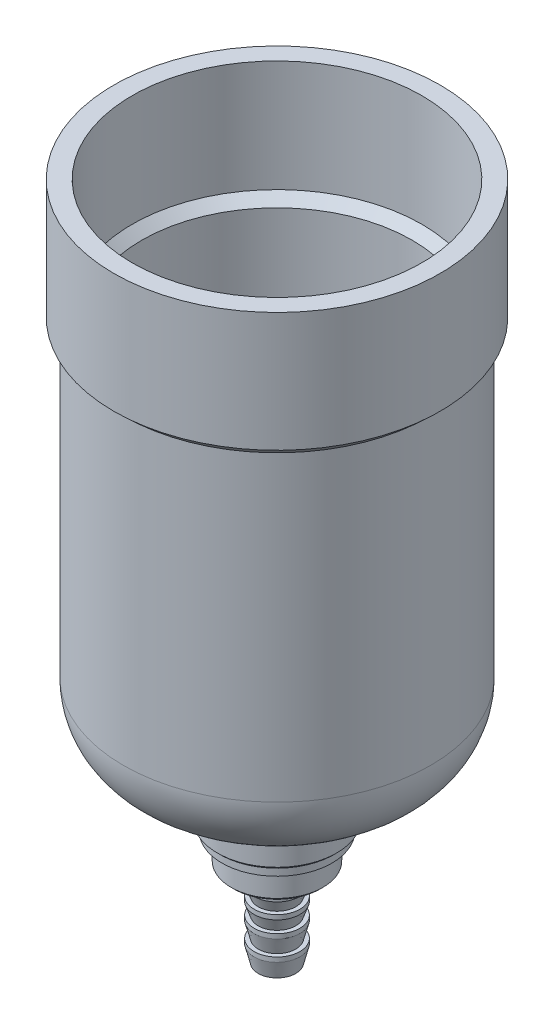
ISO-10303-21;
HEADER;
FILE_DESCRIPTION(('STEP AP214'),'2;1');
FILE_NAME('part.step','',(''),(''),'','','');
FILE_SCHEMA(('AUTOMOTIVE_DESIGN { 1 0 10303 214 1 1 1 1 }'));
ENDSEC;
DATA;
#1=APPLICATION_CONTEXT('core data for automotive mechanical design processes');
#2=APPLICATION_PROTOCOL_DEFINITION('international standard','automotive_design',2000,#1);
#3=PRODUCT_CONTEXT('',#1,'mechanical');
#4=PRODUCT('Part','Part','',(#3));
#5=PRODUCT_RELATED_PRODUCT_CATEGORY('part','',(#4));
#6=PRODUCT_DEFINITION_FORMATION('','',#4);
#7=PRODUCT_DEFINITION_CONTEXT('part definition',#1,'design');
#8=PRODUCT_DEFINITION('design','',#6,#7);
#9=PRODUCT_DEFINITION_SHAPE('','',#8);
#10=(LENGTH_UNIT() NAMED_UNIT(*) SI_UNIT(.MILLI.,.METRE.));
#11=(NAMED_UNIT(*) PLANE_ANGLE_UNIT() SI_UNIT($,.RADIAN.));
#12=(NAMED_UNIT(*) SI_UNIT($,.STERADIAN.) SOLID_ANGLE_UNIT());
#13=UNCERTAINTY_MEASURE_WITH_UNIT(LENGTH_MEASURE(1.E-05),#10,'distance_accuracy_value','');
#14=(GEOMETRIC_REPRESENTATION_CONTEXT(3) GLOBAL_UNCERTAINTY_ASSIGNED_CONTEXT((#13)) GLOBAL_UNIT_ASSIGNED_CONTEXT((#10,
#11,#12)) REPRESENTATION_CONTEXT('',''));
#15=CARTESIAN_POINT('',(0.,0.,0.));
#16=DIRECTION('',(0.,0.,1.));
#17=DIRECTION('',(1.,0.,0.));
#18=AXIS2_PLACEMENT_3D('',#15,#16,#17);
#19=CARTESIAN_POINT('',(0.,0.,0.));
#20=DIRECTION('',(0.,-1.,0.));
#21=DIRECTION('',(0.,0.,-1.));
#22=AXIS2_PLACEMENT_3D('',#19,#20,#21);
#23=CYLINDRICAL_SURFACE('',#22,17.8);
#24=CARTESIAN_POINT('',(0.,-13.0208591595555,0.));
#25=DIRECTION('',(0.,-1.,0.));
#26=DIRECTION('',(0.,0.,-1.));
#27=AXIS2_PLACEMENT_3D('',#24,#25,#26);
#28=CIRCLE('',#27,17.8);
#29=CARTESIAN_POINT('',(0.,-13.0208591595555,-17.8));
#30=VERTEX_POINT('',#29);
#31=EDGE_CURVE('E10',#30,#30,#28,.T.);
#32=ORIENTED_EDGE('',*,*,#31,.F.);
#33=EDGE_LOOP('',(#32));
#34=FACE_BOUND('',#33,.T.);
#35=CARTESIAN_POINT('',(0.,0.,0.));
#36=DIRECTION('',(0.,-1.,0.));
#37=DIRECTION('',(0.,0.,-1.));
#38=AXIS2_PLACEMENT_3D('',#35,#36,#37);
#39=CIRCLE('',#38,17.8);
#40=CARTESIAN_POINT('',(0.,0.,-17.8));
#41=VERTEX_POINT('',#40);
#42=EDGE_CURVE('E142',#41,#41,#39,.T.);
#43=ORIENTED_EDGE('',*,*,#42,.T.);
#44=EDGE_LOOP('',(#43));
#45=FACE_BOUND('',#44,.T.);
#46=ADVANCED_FACE('F33',(#34,#45),#23,.T.);
#47=CARTESIAN_POINT('',(0.,-13.0208591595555,0.));
#48=DIRECTION('',(0.,1.,0.));
#49=DIRECTION('',(0.,0.,1.));
#50=AXIS2_PLACEMENT_3D('',#47,#48,#49);
#51=CONICAL_SURFACE('',#50,17.8,0.820304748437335);
#52=CARTESIAN_POINT('',(0.,-14.,0.));
#53=DIRECTION('',(0.,-1.,0.));
#54=DIRECTION('',(0.,0.,-1.));
#55=AXIS2_PLACEMENT_3D('',#52,#53,#54);
#56=CIRCLE('',#55,16.75);
#57=CARTESIAN_POINT('',(0.,-14.,-16.75));
#58=VERTEX_POINT('',#57);
#59=EDGE_CURVE('E39',#58,#58,#56,.T.);
#60=ORIENTED_EDGE('',*,*,#59,.F.);
#61=EDGE_LOOP('',(#60));
#62=FACE_BOUND('',#61,.T.);
#63=ORIENTED_EDGE('',*,*,#31,.T.);
#64=EDGE_LOOP('',(#63));
#65=FACE_BOUND('',#64,.T.);
#66=ADVANCED_FACE('F341',(#62,#65),#51,.T.);
#67=CARTESIAN_POINT('',(0.,0.,0.));
#68=DIRECTION('',(0.,-1.,0.));
#69=DIRECTION('',(0.,0.,-1.));
#70=AXIS2_PLACEMENT_3D('',#67,#68,#69);
#71=CYLINDRICAL_SURFACE('',#70,16.75);
#72=CARTESIAN_POINT('',(0.,-47.,0.));
#73=DIRECTION('',(0.,-1.,0.));
#74=DIRECTION('',(0.,0.,-1.));
#75=AXIS2_PLACEMENT_3D('',#72,#73,#74);
#76=CIRCLE('',#75,16.75);
#77=CARTESIAN_POINT('',(0.,-47.,-16.75));
#78=VERTEX_POINT('',#77);
#79=EDGE_CURVE('E43',#78,#78,#76,.T.);
#80=ORIENTED_EDGE('',*,*,#79,.F.);
#81=EDGE_LOOP('',(#80));
#82=FACE_BOUND('',#81,.T.);
#83=ORIENTED_EDGE('',*,*,#59,.T.);
#84=EDGE_LOOP('',(#83));
#85=FACE_BOUND('',#84,.T.);
#86=ADVANCED_FACE('F336',(#82,#85),#71,.T.);
#87=CARTESIAN_POINT('',(0.,-47.,0.));
#88=DIRECTION('',(0.,-1.,0.));
#89=DIRECTION('',(0.,0.,-1.));
#90=AXIS2_PLACEMENT_3D('',#87,#88,#89);
#91=TOROIDAL_SURFACE('',#90,8.75,8.);
#92=CARTESIAN_POINT('',(0.,-55.,0.));
#93=DIRECTION('',(0.,-1.,0.));
#94=DIRECTION('',(0.,0.,-1.));
#95=AXIS2_PLACEMENT_3D('',#92,#93,#94);
#96=CIRCLE('',#95,8.75);
#97=CARTESIAN_POINT('',(0.,-55.,-8.75));
#98=VERTEX_POINT('',#97);
#99=EDGE_CURVE('E47',#98,#98,#96,.T.);
#100=ORIENTED_EDGE('',*,*,#99,.F.);
#101=EDGE_LOOP('',(#100));
#102=FACE_BOUND('',#101,.T.);
#103=ORIENTED_EDGE('',*,*,#79,.T.);
#104=EDGE_LOOP('',(#103));
#105=FACE_BOUND('',#104,.T.);
#106=ADVANCED_FACE('F330',(#102,#105),#91,.T.);
#107=CARTESIAN_POINT('',(-8.75,-55.,0.));
#108=DIRECTION('',(0.,1.,0.));
#109=DIRECTION('',(0.,0.,1.));
#110=AXIS2_PLACEMENT_3D('',#107,#108,#109);
#111=PLANE('',#110);
#112=CARTESIAN_POINT('',(0.,-55.,0.));
#113=DIRECTION('',(0.,-1.,0.));
#114=DIRECTION('',(0.,0.,-1.));
#115=AXIS2_PLACEMENT_3D('',#112,#113,#114);
#116=CIRCLE('',#115,7.5);
#117=CARTESIAN_POINT('',(0.,-55.,-7.5));
#118=VERTEX_POINT('',#117);
#119=EDGE_CURVE('E52',#118,#118,#116,.T.);
#120=ORIENTED_EDGE('',*,*,#119,.F.);
#121=EDGE_LOOP('',(#120));
#122=FACE_BOUND('',#121,.T.);
#123=ORIENTED_EDGE('',*,*,#99,.T.);
#124=EDGE_LOOP('',(#123));
#125=FACE_BOUND('',#124,.T.);
#126=ADVANCED_FACE('F324',(#122,#125),#111,.F.);
#127=CARTESIAN_POINT('',(0.,-56.,0.));
#128=DIRECTION('',(0.,-1.,0.));
#129=DIRECTION('',(0.,0.,-1.));
#130=AXIS2_PLACEMENT_3D('',#127,#128,#129);
#131=TOROIDAL_SURFACE('',#130,7.5,1.);
#132=CARTESIAN_POINT('',(0.,-56.,0.));
#133=DIRECTION('',(0.,-1.,0.));
#134=DIRECTION('',(0.,0.,-1.));
#135=AXIS2_PLACEMENT_3D('',#132,#133,#134);
#136=CIRCLE('',#135,6.5);
#137=CARTESIAN_POINT('',(0.,-56.,-6.5));
#138=VERTEX_POINT('',#137);
#139=EDGE_CURVE('E55',#138,#138,#136,.T.);
#140=ORIENTED_EDGE('',*,*,#139,.F.);
#141=EDGE_LOOP('',(#140));
#142=FACE_BOUND('',#141,.T.);
#143=ORIENTED_EDGE('',*,*,#119,.T.);
#144=EDGE_LOOP('',(#143));
#145=FACE_BOUND('',#144,.T.);
#146=ADVANCED_FACE('F318',(#142,#145),#131,.F.);
#147=CARTESIAN_POINT('',(0.,0.,0.));
#148=DIRECTION('',(0.,-1.,0.));
#149=DIRECTION('',(0.,0.,-1.));
#150=AXIS2_PLACEMENT_3D('',#147,#148,#149);
#151=CYLINDRICAL_SURFACE('',#150,6.5);
#152=CARTESIAN_POINT('',(0.,-60.4,0.));
#153=DIRECTION('',(0.,-1.,0.));
#154=DIRECTION('',(0.,0.,-1.));
#155=AXIS2_PLACEMENT_3D('',#152,#153,#154);
#156=CIRCLE('',#155,6.5);
#157=CARTESIAN_POINT('',(0.,-60.4,-6.5));
#158=VERTEX_POINT('',#157);
#159=EDGE_CURVE('E58',#158,#158,#156,.T.);
#160=ORIENTED_EDGE('',*,*,#159,.F.);
#161=EDGE_LOOP('',(#160));
#162=FACE_BOUND('',#161,.T.);
#163=ORIENTED_EDGE('',*,*,#139,.T.);
#164=EDGE_LOOP('',(#163));
#165=FACE_BOUND('',#164,.T.);
#166=ADVANCED_FACE('F312',(#162,#165),#151,.T.);
#167=CARTESIAN_POINT('',(0.,-60.4,0.));
#168=DIRECTION('',(0.,1.,0.));
#169=DIRECTION('',(0.,0.,1.));
#170=AXIS2_PLACEMENT_3D('',#167,#168,#169);
#171=CONICAL_SURFACE('',#170,6.5,0.785398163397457);
#172=CARTESIAN_POINT('',(0.,-60.7,0.));
#173=DIRECTION('',(0.,-1.,0.));
#174=DIRECTION('',(0.,0.,-1.));
#175=AXIS2_PLACEMENT_3D('',#172,#173,#174);
#176=CIRCLE('',#175,6.2);
#177=CARTESIAN_POINT('',(0.,-60.7,-6.2));
#178=VERTEX_POINT('',#177);
#179=EDGE_CURVE('E61',#178,#178,#176,.T.);
#180=ORIENTED_EDGE('',*,*,#179,.F.);
#181=EDGE_LOOP('',(#180));
#182=FACE_BOUND('',#181,.T.);
#183=ORIENTED_EDGE('',*,*,#159,.T.);
#184=EDGE_LOOP('',(#183));
#185=FACE_BOUND('',#184,.T.);
#186=ADVANCED_FACE('F306',(#182,#185),#171,.T.);
#187=CARTESIAN_POINT('',(-6.2,-60.7,0.));
#188=DIRECTION('',(0.,1.,0.));
#189=DIRECTION('',(0.,0.,1.));
#190=AXIS2_PLACEMENT_3D('',#187,#188,#189);
#191=PLANE('',#190);
#192=CARTESIAN_POINT('',(0.,-60.7,0.));
#193=DIRECTION('',(0.,-1.,0.));
#194=DIRECTION('',(0.,0.,-1.));
#195=AXIS2_PLACEMENT_3D('',#192,#193,#194);
#196=CIRCLE('',#195,6.);
#197=CARTESIAN_POINT('',(0.,-60.7,-6.));
#198=VERTEX_POINT('',#197);
#199=EDGE_CURVE('E64',#198,#198,#196,.T.);
#200=ORIENTED_EDGE('',*,*,#199,.F.);
#201=EDGE_LOOP('',(#200));
#202=FACE_BOUND('',#201,.T.);
#203=ORIENTED_EDGE('',*,*,#179,.T.);
#204=EDGE_LOOP('',(#203));
#205=FACE_BOUND('',#204,.T.);
#206=ADVANCED_FACE('F300',(#202,#205),#191,.F.);
#207=CARTESIAN_POINT('',(0.,0.,0.));
#208=DIRECTION('',(0.,-1.,0.));
#209=DIRECTION('',(0.,0.,-1.));
#210=AXIS2_PLACEMENT_3D('',#207,#208,#209);
#211=CYLINDRICAL_SURFACE('',#210,6.);
#212=CARTESIAN_POINT('',(0.,-61.6,0.));
#213=DIRECTION('',(0.,-1.,0.));
#214=DIRECTION('',(0.,0.,-1.));
#215=AXIS2_PLACEMENT_3D('',#212,#213,#214);
#216=CIRCLE('',#215,6.);
#217=CARTESIAN_POINT('',(0.,-61.6,-6.));
#218=VERTEX_POINT('',#217);
#219=EDGE_CURVE('E67',#218,#218,#216,.T.);
#220=ORIENTED_EDGE('',*,*,#219,.F.);
#221=EDGE_LOOP('',(#220));
#222=FACE_BOUND('',#221,.T.);
#223=ORIENTED_EDGE('',*,*,#199,.T.);
#224=EDGE_LOOP('',(#223));
#225=FACE_BOUND('',#224,.T.);
#226=ADVANCED_FACE('F294',(#222,#225),#211,.T.);
#227=CARTESIAN_POINT('',(-6.,-61.6,0.));
#228=DIRECTION('',(0.,1.,0.));
#229=DIRECTION('',(0.,0.,1.));
#230=AXIS2_PLACEMENT_3D('',#227,#228,#229);
#231=PLANE('',#230);
#232=CARTESIAN_POINT('',(0.,-61.6,0.));
#233=DIRECTION('',(0.,-1.,0.));
#234=DIRECTION('',(0.,0.,-1.));
#235=AXIS2_PLACEMENT_3D('',#232,#233,#234);
#236=CIRCLE('',#235,5.);
#237=CARTESIAN_POINT('',(0.,-61.6,-5.));
#238=VERTEX_POINT('',#237);
#239=EDGE_CURVE('E70',#238,#238,#236,.T.);
#240=ORIENTED_EDGE('',*,*,#239,.F.);
#241=EDGE_LOOP('',(#240));
#242=FACE_BOUND('',#241,.T.);
#243=ORIENTED_EDGE('',*,*,#219,.T.);
#244=EDGE_LOOP('',(#243));
#245=FACE_BOUND('',#244,.T.);
#246=ADVANCED_FACE('F288',(#242,#245),#231,.F.);
#247=CARTESIAN_POINT('',(0.,0.,0.));
#248=DIRECTION('',(0.,-1.,0.));
#249=DIRECTION('',(0.,0.,-1.));
#250=AXIS2_PLACEMENT_3D('',#247,#248,#249);
#251=CYLINDRICAL_SURFACE('',#250,5.);
#252=CARTESIAN_POINT('',(0.,-64.4,0.));
#253=DIRECTION('',(0.,-1.,0.));
#254=DIRECTION('',(0.,0.,-1.));
#255=AXIS2_PLACEMENT_3D('',#252,#253,#254);
#256=CIRCLE('',#255,5.);
#257=CARTESIAN_POINT('',(0.,-64.4,-5.));
#258=VERTEX_POINT('',#257);
#259=EDGE_CURVE('E73',#258,#258,#256,.T.);
#260=ORIENTED_EDGE('',*,*,#259,.F.);
#261=EDGE_LOOP('',(#260));
#262=FACE_BOUND('',#261,.T.);
#263=ORIENTED_EDGE('',*,*,#239,.T.);
#264=EDGE_LOOP('',(#263));
#265=FACE_BOUND('',#264,.T.);
#266=ADVANCED_FACE('F282',(#262,#265),#251,.T.);
#267=CARTESIAN_POINT('',(0.,-64.4,0.));
#268=DIRECTION('',(0.,1.,0.));
#269=DIRECTION('',(0.,0.,1.));
#270=AXIS2_PLACEMENT_3D('',#267,#268,#269);
#271=CONICAL_SURFACE('',#270,5.,0.785398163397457);
#272=CARTESIAN_POINT('',(0.,-64.7,0.));
#273=DIRECTION('',(0.,-1.,0.));
#274=DIRECTION('',(0.,0.,-1.));
#275=AXIS2_PLACEMENT_3D('',#272,#273,#274);
#276=CIRCLE('',#275,4.7);
#277=CARTESIAN_POINT('',(0.,-64.7,-4.7));
#278=VERTEX_POINT('',#277);
#279=EDGE_CURVE('E76',#278,#278,#276,.T.);
#280=ORIENTED_EDGE('',*,*,#279,.F.);
#281=EDGE_LOOP('',(#280));
#282=FACE_BOUND('',#281,.T.);
#283=ORIENTED_EDGE('',*,*,#259,.T.);
#284=EDGE_LOOP('',(#283));
#285=FACE_BOUND('',#284,.T.);
#286=ADVANCED_FACE('F276',(#282,#285),#271,.T.);
#287=CARTESIAN_POINT('',(-4.7,-64.7,0.));
#288=DIRECTION('',(0.,1.,0.));
#289=DIRECTION('',(0.,0.,1.));
#290=AXIS2_PLACEMENT_3D('',#287,#288,#289);
#291=PLANE('',#290);
#292=CARTESIAN_POINT('',(0.,-64.7,0.));
#293=DIRECTION('',(0.,-1.,0.));
#294=DIRECTION('',(0.,0.,-1.));
#295=AXIS2_PLACEMENT_3D('',#292,#293,#294);
#296=CIRCLE('',#295,3.5);
#297=CARTESIAN_POINT('',(0.,-64.7,-3.5));
#298=VERTEX_POINT('',#297);
#299=EDGE_CURVE('E79',#298,#298,#296,.T.);
#300=ORIENTED_EDGE('',*,*,#299,.F.);
#301=EDGE_LOOP('',(#300));
#302=FACE_BOUND('',#301,.T.);
#303=ORIENTED_EDGE('',*,*,#279,.T.);
#304=EDGE_LOOP('',(#303));
#305=FACE_BOUND('',#304,.T.);
#306=ADVANCED_FACE('F270',(#302,#305),#291,.F.);
#307=CARTESIAN_POINT('',(0.,0.,0.));
#308=DIRECTION('',(0.,-1.,0.));
#309=DIRECTION('',(0.,0.,-1.));
#310=AXIS2_PLACEMENT_3D('',#307,#308,#309);
#311=CYLINDRICAL_SURFACE('',#310,3.5);
#312=CARTESIAN_POINT('',(0.,-65.5,0.));
#313=DIRECTION('',(0.,-1.,0.));
#314=DIRECTION('',(0.,0.,-1.));
#315=AXIS2_PLACEMENT_3D('',#312,#313,#314);
#316=CIRCLE('',#315,3.5);
#317=CARTESIAN_POINT('',(0.,-65.5,-3.5));
#318=VERTEX_POINT('',#317);
#319=EDGE_CURVE('E82',#318,#318,#316,.T.);
#320=ORIENTED_EDGE('',*,*,#319,.F.);
#321=EDGE_LOOP('',(#320));
#322=FACE_BOUND('',#321,.T.);
#323=ORIENTED_EDGE('',*,*,#299,.T.);
#324=EDGE_LOOP('',(#323));
#325=FACE_BOUND('',#324,.T.);
#326=ADVANCED_FACE('F264',(#322,#325),#311,.T.);
#327=CARTESIAN_POINT('',(-3.5,-65.5,0.));
#328=DIRECTION('',(0.,1.,0.));
#329=DIRECTION('',(0.,0.,1.));
#330=AXIS2_PLACEMENT_3D('',#327,#328,#329);
#331=PLANE('',#330);
#332=CARTESIAN_POINT('',(0.,-65.5,0.));
#333=DIRECTION('',(0.,-1.,0.));
#334=DIRECTION('',(0.,0.,-1.));
#335=AXIS2_PLACEMENT_3D('',#332,#333,#334);
#336=CIRCLE('',#335,2.5);
#337=CARTESIAN_POINT('',(0.,-65.5,-2.5));
#338=VERTEX_POINT('',#337);
#339=EDGE_CURVE('E85',#338,#338,#336,.T.);
#340=ORIENTED_EDGE('',*,*,#339,.F.);
#341=EDGE_LOOP('',(#340));
#342=FACE_BOUND('',#341,.T.);
#343=ORIENTED_EDGE('',*,*,#319,.T.);
#344=EDGE_LOOP('',(#343));
#345=FACE_BOUND('',#344,.T.);
#346=ADVANCED_FACE('F258',(#342,#345),#331,.F.);
#347=CARTESIAN_POINT('',(0.,0.,0.));
#348=DIRECTION('',(0.,-1.,0.));
#349=DIRECTION('',(0.,0.,-1.));
#350=AXIS2_PLACEMENT_3D('',#347,#348,#349);
#351=CYLINDRICAL_SURFACE('',#350,2.5);
#352=CARTESIAN_POINT('',(0.,-66.5,0.));
#353=DIRECTION('',(0.,-1.,0.));
#354=DIRECTION('',(0.,0.,-1.));
#355=AXIS2_PLACEMENT_3D('',#352,#353,#354);
#356=CIRCLE('',#355,2.5);
#357=CARTESIAN_POINT('',(0.,-66.5,-2.5));
#358=VERTEX_POINT('',#357);
#359=EDGE_CURVE('E88',#358,#358,#356,.T.);
#360=ORIENTED_EDGE('',*,*,#359,.F.);
#361=EDGE_LOOP('',(#360));
#362=FACE_BOUND('',#361,.T.);
#363=ORIENTED_EDGE('',*,*,#339,.T.);
#364=EDGE_LOOP('',(#363));
#365=FACE_BOUND('',#364,.T.);
#366=ADVANCED_FACE('F252',(#362,#365),#351,.T.);
#367=CARTESIAN_POINT('',(0.,-66.5,0.));
#368=DIRECTION('',(0.,1.,0.));
#369=DIRECTION('',(0.,0.,1.));
#370=AXIS2_PLACEMENT_3D('',#367,#368,#369);
#371=CONICAL_SURFACE('',#370,2.5,0.358770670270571);
#372=CARTESIAN_POINT('',(0.,-67.7,0.));
#373=DIRECTION('',(0.,-1.,0.));
#374=DIRECTION('',(0.,0.,-1.));
#375=AXIS2_PLACEMENT_3D('',#372,#373,#374);
#376=CIRCLE('',#375,2.05);
#377=CARTESIAN_POINT('',(0.,-67.7,-2.05));
#378=VERTEX_POINT('',#377);
#379=EDGE_CURVE('E91',#378,#378,#376,.T.);
#380=ORIENTED_EDGE('',*,*,#379,.F.);
#381=EDGE_LOOP('',(#380));
#382=FACE_BOUND('',#381,.T.);
#383=ORIENTED_EDGE('',*,*,#359,.T.);
#384=EDGE_LOOP('',(#383));
#385=FACE_BOUND('',#384,.T.);
#386=ADVANCED_FACE('F246',(#382,#385),#371,.T.);
#387=CARTESIAN_POINT('',(-2.05,-67.7,0.));
#388=DIRECTION('',(0.,-1.,0.));
#389=DIRECTION('',(0.,0.,-1.));
#390=AXIS2_PLACEMENT_3D('',#387,#388,#389);
#391=PLANE('',#390);
#392=CARTESIAN_POINT('',(0.,-67.7,0.));
#393=DIRECTION('',(0.,-1.,0.));
#394=DIRECTION('',(0.,0.,-1.));
#395=AXIS2_PLACEMENT_3D('',#392,#393,#394);
#396=CIRCLE('',#395,2.5);
#397=CARTESIAN_POINT('',(0.,-67.7,-2.5));
#398=VERTEX_POINT('',#397);
#399=EDGE_CURVE('E94',#398,#398,#396,.T.);
#400=ORIENTED_EDGE('',*,*,#399,.F.);
#401=EDGE_LOOP('',(#400));
#402=FACE_BOUND('',#401,.T.);
#403=ORIENTED_EDGE('',*,*,#379,.T.);
#404=EDGE_LOOP('',(#403));
#405=FACE_BOUND('',#404,.T.);
#406=ADVANCED_FACE('F240',(#402,#405),#391,.F.);
#407=CARTESIAN_POINT('',(0.,0.,0.));
#408=DIRECTION('',(0.,-1.,0.));
#409=DIRECTION('',(0.,0.,-1.));
#410=AXIS2_PLACEMENT_3D('',#407,#408,#409);
#411=CYLINDRICAL_SURFACE('',#410,2.5);
#412=CARTESIAN_POINT('',(0.,-68.2,0.));
#413=DIRECTION('',(0.,-1.,0.));
#414=DIRECTION('',(0.,0.,-1.));
#415=AXIS2_PLACEMENT_3D('',#412,#413,#414);
#416=CIRCLE('',#415,2.5);
#417=CARTESIAN_POINT('',(0.,-68.2,-2.5));
#418=VERTEX_POINT('',#417);
#419=EDGE_CURVE('E97',#418,#418,#416,.T.);
#420=ORIENTED_EDGE('',*,*,#419,.F.);
#421=EDGE_LOOP('',(#420));
#422=FACE_BOUND('',#421,.T.);
#423=ORIENTED_EDGE('',*,*,#399,.T.);
#424=EDGE_LOOP('',(#423));
#425=FACE_BOUND('',#424,.T.);
#426=ADVANCED_FACE('F234',(#422,#425),#411,.T.);
#427=CARTESIAN_POINT('',(0.,-68.2,0.));
#428=DIRECTION('',(0.,1.,0.));
#429=DIRECTION('',(0.,0.,1.));
#430=AXIS2_PLACEMENT_3D('',#427,#428,#429);
#431=CONICAL_SURFACE('',#430,2.5,0.333244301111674);
#432=CARTESIAN_POINT('',(0.,-69.5,0.));
#433=DIRECTION('',(0.,-1.,0.));
#434=DIRECTION('',(0.,0.,-1.));
#435=AXIS2_PLACEMENT_3D('',#432,#433,#434);
#436=CIRCLE('',#435,2.05);
#437=CARTESIAN_POINT('',(0.,-69.5,-2.05));
#438=VERTEX_POINT('',#437);
#439=EDGE_CURVE('E100',#438,#438,#436,.T.);
#440=ORIENTED_EDGE('',*,*,#439,.F.);
#441=EDGE_LOOP('',(#440));
#442=FACE_BOUND('',#441,.T.);
#443=ORIENTED_EDGE('',*,*,#419,.T.);
#444=EDGE_LOOP('',(#443));
#445=FACE_BOUND('',#444,.T.);
#446=ADVANCED_FACE('F228',(#442,#445),#431,.T.);
#447=CARTESIAN_POINT('',(-2.05,-69.5,0.));
#448=DIRECTION('',(0.,-1.,0.));
#449=DIRECTION('',(0.,0.,-1.));
#450=AXIS2_PLACEMENT_3D('',#447,#448,#449);
#451=PLANE('',#450);
#452=CARTESIAN_POINT('',(0.,-69.5,0.));
#453=DIRECTION('',(0.,-1.,0.));
#454=DIRECTION('',(0.,0.,-1.));
#455=AXIS2_PLACEMENT_3D('',#452,#453,#454);
#456=CIRCLE('',#455,2.5);
#457=CARTESIAN_POINT('',(0.,-69.5,-2.5));
#458=VERTEX_POINT('',#457);
#459=EDGE_CURVE('E103',#458,#458,#456,.T.);
#460=ORIENTED_EDGE('',*,*,#459,.F.);
#461=EDGE_LOOP('',(#460));
#462=FACE_BOUND('',#461,.T.);
#463=ORIENTED_EDGE('',*,*,#439,.T.);
#464=EDGE_LOOP('',(#463));
#465=FACE_BOUND('',#464,.T.);
#466=ADVANCED_FACE('F222',(#462,#465),#451,.F.);
#467=CARTESIAN_POINT('',(0.,0.,0.));
#468=DIRECTION('',(0.,-1.,0.));
#469=DIRECTION('',(0.,0.,-1.));
#470=AXIS2_PLACEMENT_3D('',#467,#468,#469);
#471=CYLINDRICAL_SURFACE('',#470,2.5);
#472=CARTESIAN_POINT('',(0.,-70.,0.));
#473=DIRECTION('',(0.,-1.,0.));
#474=DIRECTION('',(0.,0.,-1.));
#475=AXIS2_PLACEMENT_3D('',#472,#473,#474);
#476=CIRCLE('',#475,2.5);
#477=CARTESIAN_POINT('',(0.,-70.,-2.5));
#478=VERTEX_POINT('',#477);
#479=EDGE_CURVE('E106',#478,#478,#476,.T.);
#480=ORIENTED_EDGE('',*,*,#479,.F.);
#481=EDGE_LOOP('',(#480));
#482=FACE_BOUND('',#481,.T.);
#483=ORIENTED_EDGE('',*,*,#459,.T.);
#484=EDGE_LOOP('',(#483));
#485=FACE_BOUND('',#484,.T.);
#486=ADVANCED_FACE('F216',(#482,#485),#471,.T.);
#487=CARTESIAN_POINT('',(0.,-70.,0.));
#488=DIRECTION('',(0.,1.,0.));
#489=DIRECTION('',(0.,0.,1.));
#490=AXIS2_PLACEMENT_3D('',#487,#488,#489);
#491=CONICAL_SURFACE('',#490,2.5,0.258770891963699);
#492=CARTESIAN_POINT('',(0.,-71.7,0.));
#493=DIRECTION('',(0.,-1.,0.));
#494=DIRECTION('',(0.,0.,-1.));
#495=AXIS2_PLACEMENT_3D('',#492,#493,#494);
#496=CIRCLE('',#495,2.05);
#497=CARTESIAN_POINT('',(0.,-71.7,-2.05));
#498=VERTEX_POINT('',#497);
#499=EDGE_CURVE('E109',#498,#498,#496,.T.);
#500=ORIENTED_EDGE('',*,*,#499,.F.);
#501=EDGE_LOOP('',(#500));
#502=FACE_BOUND('',#501,.T.);
#503=ORIENTED_EDGE('',*,*,#479,.T.);
#504=EDGE_LOOP('',(#503));
#505=FACE_BOUND('',#504,.T.);
#506=ADVANCED_FACE('F210',(#502,#505),#491,.T.);
#507=CARTESIAN_POINT('',(-2.05,-71.7,0.));
#508=DIRECTION('',(0.,-1.,0.));
#509=DIRECTION('',(0.,0.,-1.));
#510=AXIS2_PLACEMENT_3D('',#507,#508,#509);
#511=PLANE('',#510);
#512=CARTESIAN_POINT('',(0.,-71.7,0.));
#513=DIRECTION('',(0.,-1.,0.));
#514=DIRECTION('',(0.,0.,-1.));
#515=AXIS2_PLACEMENT_3D('',#512,#513,#514);
#516=CIRCLE('',#515,2.5);
#517=CARTESIAN_POINT('',(0.,-71.7,-2.5));
#518=VERTEX_POINT('',#517);
#519=EDGE_CURVE('E112',#518,#518,#516,.T.);
#520=ORIENTED_EDGE('',*,*,#519,.F.);
#521=EDGE_LOOP('',(#520));
#522=FACE_BOUND('',#521,.T.);
#523=ORIENTED_EDGE('',*,*,#499,.T.);
#524=EDGE_LOOP('',(#523));
#525=FACE_BOUND('',#524,.T.);
#526=ADVANCED_FACE('F204',(#522,#525),#511,.F.);
#527=CARTESIAN_POINT('',(0.,0.,0.));
#528=DIRECTION('',(0.,-1.,0.));
#529=DIRECTION('',(0.,0.,-1.));
#530=AXIS2_PLACEMENT_3D('',#527,#528,#529);
#531=CYLINDRICAL_SURFACE('',#530,2.5);
#532=CARTESIAN_POINT('',(0.,-72.2,0.));
#533=DIRECTION('',(0.,-1.,0.));
#534=DIRECTION('',(0.,0.,-1.));
#535=AXIS2_PLACEMENT_3D('',#532,#533,#534);
#536=CIRCLE('',#535,2.5);
#537=CARTESIAN_POINT('',(0.,-72.2,-2.5));
#538=VERTEX_POINT('',#537);
#539=EDGE_CURVE('E115',#538,#538,#536,.T.);
#540=ORIENTED_EDGE('',*,*,#539,.F.);
#541=EDGE_LOOP('',(#540));
#542=FACE_BOUND('',#541,.T.);
#543=ORIENTED_EDGE('',*,*,#519,.T.);
#544=EDGE_LOOP('',(#543));
#545=FACE_BOUND('',#544,.T.);
#546=ADVANCED_FACE('F198',(#542,#545),#531,.T.);
#547=CARTESIAN_POINT('',(0.,-72.2,0.));
#548=DIRECTION('',(0.,1.,0.));
#549=DIRECTION('',(0.,0.,1.));
#550=AXIS2_PLACEMENT_3D('',#547,#548,#549);
#551=CONICAL_SURFACE('',#550,2.5,0.244978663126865);
#552=CARTESIAN_POINT('',(0.,-74.,0.));
#553=DIRECTION('',(0.,-1.,0.));
#554=DIRECTION('',(0.,0.,-1.));
#555=AXIS2_PLACEMENT_3D('',#552,#553,#554);
#556=CIRCLE('',#555,2.05);
#557=CARTESIAN_POINT('',(0.,-74.,-2.05));
#558=VERTEX_POINT('',#557);
#559=EDGE_CURVE('E118',#558,#558,#556,.T.);
#560=ORIENTED_EDGE('',*,*,#559,.F.);
#561=EDGE_LOOP('',(#560));
#562=FACE_BOUND('',#561,.T.);
#563=ORIENTED_EDGE('',*,*,#539,.T.);
#564=EDGE_LOOP('',(#563));
#565=FACE_BOUND('',#564,.T.);
#566=ADVANCED_FACE('F192',(#562,#565),#551,.T.);
#567=CARTESIAN_POINT('',(-2.05,-74.,0.));
#568=DIRECTION('',(0.,1.,0.));
#569=DIRECTION('',(0.,0.,1.));
#570=AXIS2_PLACEMENT_3D('',#567,#568,#569);
#571=PLANE('',#570);
#572=CARTESIAN_POINT('',(0.,-74.,0.));
#573=DIRECTION('',(0.,-1.,0.));
#574=DIRECTION('',(0.,0.,-1.));
#575=AXIS2_PLACEMENT_3D('',#572,#573,#574);
#576=CIRCLE('',#575,1.2);
#577=CARTESIAN_POINT('',(0.,-74.,-1.2));
#578=VERTEX_POINT('',#577);
#579=EDGE_CURVE('E121',#578,#578,#576,.T.);
#580=ORIENTED_EDGE('',*,*,#579,.F.);
#581=EDGE_LOOP('',(#580));
#582=FACE_BOUND('',#581,.T.);
#583=ORIENTED_EDGE('',*,*,#559,.T.);
#584=EDGE_LOOP('',(#583));
#585=FACE_BOUND('',#584,.T.);
#586=ADVANCED_FACE('F186',(#582,#585),#571,.F.);
#587=CARTESIAN_POINT('',(0.,0.,0.));
#588=DIRECTION('',(0.,-1.,0.));
#589=DIRECTION('',(0.,0.,-1.));
#590=AXIS2_PLACEMENT_3D('',#587,#588,#589);
#591=CYLINDRICAL_SURFACE('',#590,1.2);
#592=CARTESIAN_POINT('',(0.,-53.,0.));
#593=DIRECTION('',(0.,-1.,0.));
#594=DIRECTION('',(0.,0.,-1.));
#595=AXIS2_PLACEMENT_3D('',#592,#593,#594);
#596=CIRCLE('',#595,1.2);
#597=CARTESIAN_POINT('',(0.,-53.,-1.2));
#598=VERTEX_POINT('',#597);
#599=EDGE_CURVE('E124',#598,#598,#596,.T.);
#600=ORIENTED_EDGE('',*,*,#599,.F.);
#601=EDGE_LOOP('',(#600));
#602=FACE_BOUND('',#601,.T.);
#603=ORIENTED_EDGE('',*,*,#579,.T.);
#604=EDGE_LOOP('',(#603));
#605=FACE_BOUND('',#604,.T.);
#606=ADVANCED_FACE('F180',(#602,#605),#591,.F.);
#607=CARTESIAN_POINT('',(-1.2,-53.,0.));
#608=DIRECTION('',(0.,-1.,0.));
#609=DIRECTION('',(0.,0.,-1.));
#610=AXIS2_PLACEMENT_3D('',#607,#608,#609);
#611=PLANE('',#610);
#612=CARTESIAN_POINT('',(0.,-53.,0.));
#613=DIRECTION('',(0.,-1.,0.));
#614=DIRECTION('',(0.,0.,-1.));
#615=AXIS2_PLACEMENT_3D('',#612,#613,#614);
#616=CIRCLE('',#615,6.75);
#617=CARTESIAN_POINT('',(0.,-53.,-6.75));
#618=VERTEX_POINT('',#617);
#619=EDGE_CURVE('E127',#618,#618,#616,.T.);
#620=ORIENTED_EDGE('',*,*,#619,.F.);
#621=EDGE_LOOP('',(#620));
#622=FACE_BOUND('',#621,.T.);
#623=ORIENTED_EDGE('',*,*,#599,.T.);
#624=EDGE_LOOP('',(#623));
#625=FACE_BOUND('',#624,.T.);
#626=ADVANCED_FACE('F174',(#622,#625),#611,.F.);
#627=CARTESIAN_POINT('',(0.,-45.,0.));
#628=DIRECTION('',(0.,-1.,0.));
#629=DIRECTION('',(0.,0.,-1.));
#630=AXIS2_PLACEMENT_3D('',#627,#628,#629);
#631=DEGENERATE_TOROIDAL_SURFACE('',#630,6.75000000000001,7.99999999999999,.T.);
#632=CARTESIAN_POINT('',(0.,-45.,0.));
#633=DIRECTION('',(0.,-1.,0.));
#634=DIRECTION('',(0.,0.,-1.));
#635=AXIS2_PLACEMENT_3D('',#632,#633,#634);
#636=CIRCLE('',#635,14.75);
#637=CARTESIAN_POINT('',(0.,-45.,-14.75));
#638=VERTEX_POINT('',#637);
#639=EDGE_CURVE('E130',#638,#638,#636,.T.);
#640=ORIENTED_EDGE('',*,*,#639,.F.);
#641=EDGE_LOOP('',(#640));
#642=FACE_BOUND('',#641,.T.);
#643=ORIENTED_EDGE('',*,*,#619,.T.);
#644=EDGE_LOOP('',(#643));
#645=FACE_BOUND('',#644,.T.);
#646=ADVANCED_FACE('F168',(#642,#645),#631,.F.);
#647=CARTESIAN_POINT('',(0.,0.,0.));
#648=DIRECTION('',(0.,-1.,0.));
#649=DIRECTION('',(0.,0.,-1.));
#650=AXIS2_PLACEMENT_3D('',#647,#648,#649);
#651=CYLINDRICAL_SURFACE('',#650,14.75);
#652=CARTESIAN_POINT('',(0.,-13.1303752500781,0.));
#653=DIRECTION('',(0.,-1.,0.));
#654=DIRECTION('',(0.,0.,-1.));
#655=AXIS2_PLACEMENT_3D('',#652,#653,#654);
#656=CIRCLE('',#655,14.75);
#657=CARTESIAN_POINT('',(0.,-13.1303752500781,-14.75));
#658=VERTEX_POINT('',#657);
#659=EDGE_CURVE('E133',#658,#658,#656,.T.);
#660=ORIENTED_EDGE('',*,*,#659,.F.);
#661=EDGE_LOOP('',(#660));
#662=FACE_BOUND('',#661,.T.);
#663=ORIENTED_EDGE('',*,*,#639,.T.);
#664=EDGE_LOOP('',(#663));
#665=FACE_BOUND('',#664,.T.);
#666=ADVANCED_FACE('F162',(#662,#665),#651,.F.);
#667=CARTESIAN_POINT('',(0.,-13.1303752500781,0.));
#668=DIRECTION('',(0.,1.,0.));
#669=DIRECTION('',(0.,0.,1.));
#670=AXIS2_PLACEMENT_3D('',#667,#668,#669);
#671=CONICAL_SURFACE('',#670,14.75,0.820304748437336);
#672=CARTESIAN_POINT('',(0.,-12.1512344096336,0.));
#673=DIRECTION('',(0.,-1.,0.));
#674=DIRECTION('',(0.,0.,-1.));
#675=AXIS2_PLACEMENT_3D('',#672,#673,#674);
#676=CIRCLE('',#675,15.8);
#677=CARTESIAN_POINT('',(0.,-12.1512344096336,-15.8));
#678=VERTEX_POINT('',#677);
#679=EDGE_CURVE('E136',#678,#678,#676,.T.);
#680=ORIENTED_EDGE('',*,*,#679,.F.);
#681=EDGE_LOOP('',(#680));
#682=FACE_BOUND('',#681,.T.);
#683=ORIENTED_EDGE('',*,*,#659,.T.);
#684=EDGE_LOOP('',(#683));
#685=FACE_BOUND('',#684,.T.);
#686=ADVANCED_FACE('F156',(#682,#685),#671,.F.);
#687=CARTESIAN_POINT('',(0.,0.,0.));
#688=DIRECTION('',(0.,-1.,0.));
#689=DIRECTION('',(0.,0.,-1.));
#690=AXIS2_PLACEMENT_3D('',#687,#688,#689);
#691=CYLINDRICAL_SURFACE('',#690,15.8);
#692=CARTESIAN_POINT('',(0.,0.,0.));
#693=DIRECTION('',(0.,-1.,0.));
#694=DIRECTION('',(0.,0.,-1.));
#695=AXIS2_PLACEMENT_3D('',#692,#693,#694);
#696=CIRCLE('',#695,15.8);
#697=CARTESIAN_POINT('',(0.,0.,-15.8));
#698=VERTEX_POINT('',#697);
#699=EDGE_CURVE('E139',#698,#698,#696,.T.);
#700=ORIENTED_EDGE('',*,*,#699,.F.);
#701=EDGE_LOOP('',(#700));
#702=FACE_BOUND('',#701,.T.);
#703=ORIENTED_EDGE('',*,*,#679,.T.);
#704=EDGE_LOOP('',(#703));
#705=FACE_BOUND('',#704,.T.);
#706=ADVANCED_FACE('F150',(#702,#705),#691,.F.);
#707=CARTESIAN_POINT('',(-15.8,0.,0.));
#708=DIRECTION('',(0.,-1.,0.));
#709=DIRECTION('',(0.,0.,-1.));
#710=AXIS2_PLACEMENT_3D('',#707,#708,#709);
#711=PLANE('',#710);
#712=ORIENTED_EDGE('',*,*,#42,.F.);
#713=EDGE_LOOP('',(#712));
#714=FACE_BOUND('',#713,.T.);
#715=ORIENTED_EDGE('',*,*,#699,.T.);
#716=EDGE_LOOP('',(#715));
#717=FACE_BOUND('',#716,.T.);
#718=ADVANCED_FACE('F147',(#714,#717),#711,.F.);
#719=CLOSED_SHELL('',(#46,#66,#86,#106,#126,#146,#166,#186,#206,#226,#246,#266,#286,#306,#326,
#346,#366,#386,#406,#426,#446,#466,#486,#506,#526,#546,#566,#586,#606,#626,#646,#666,#686,#706,#718));
#720=MANIFOLD_SOLID_BREP('B2',#719);
#721=ADVANCED_BREP_SHAPE_REPRESENTATION('',(#18,#720),#14);
#722=SHAPE_DEFINITION_REPRESENTATION(#9,#721);
ENDSEC;
END-ISO-10303-21;
